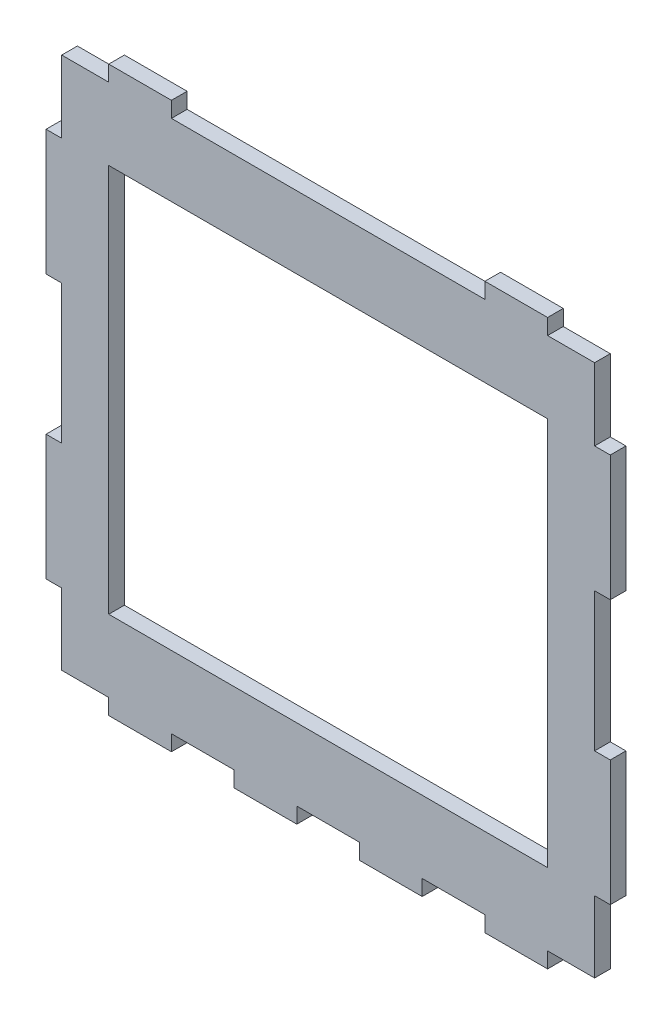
from build123d import *

# Parameters (mm, degrees)
SKETCH1_W           = 88.9
SKETCH1_H           = 78.74
BOSS_EXTRUDE1_DEPTH = 3.175
SKETCH2_W           = 3.175
SKETCH2_H           = 14.605
SKETCH2_H_2         = 28.1
SKETCH2_H_3         = 14.445
CUT_EXTRUDE1_DEPTH  = 162.675788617


with BuildPart() as part:
    # Sketch1 → Boss-Extrude1 (new body)
    with BuildSketch(Plane.XY):
        Polygon((-88.9, 114.3), (-101.6, 114.3), (-101.6, 111.125), (-114.3, 111.125), (-114.3, 3.175), (-101.6, 3.175), (-101.6, 0), (-88.9, 0), (-88.9, 3.175), (-76.2, 3.175), (-76.2, 0), (-63.5, 0), (-63.5, 3.175), (-50.8, 3.175), (-50.8, 0), (-38.1, 0), (-38.1, 3.175), (-25.4, 3.175), (-25.4, 0), (-12.7, 0), (-12.7, 3.175), (0, 3.175), (0, 111.125), (-12.7, 111.125), (-12.7, 114.3), (-25.4, 114.3), (-25.4, 111.125), (-88.9, 111.125), align=None)
        with Locations((-57.15, 57.15)):
            Rectangle(SKETCH1_W, SKETCH1_H, mode=Mode.SUBTRACT)
    extrude(amount=BOSS_EXTRUDE1_DEPTH)

    # Sketch2 → Cut-Extrude1 (cut, through all)
    with BuildSketch(Plane.XY.offset(3.175)):
        with Locations((-112.7125, 103.8225)):
            Rectangle(SKETCH2_W, SKETCH2_H)
        with Locations((-112.7125, 57.07)):
            Rectangle(SKETCH2_W, SKETCH2_H_2)
        with Locations((-112.7125, 10.3975)):
            Rectangle(SKETCH2_W, SKETCH2_H_3)
        with Locations((-1.5875, 10.3975)):
            Rectangle(SKETCH2_W, SKETCH2_H_3)
        with Locations((-1.5875, 57.07)):
            Rectangle(SKETCH2_W, SKETCH2_H_2)
        with Locations((-1.5875, 103.8225)):
            Rectangle(SKETCH2_W, SKETCH2_H)
    extrude(amount=-CUT_EXTRUDE1_DEPTH, mode=Mode.SUBTRACT)


solid = part.part
